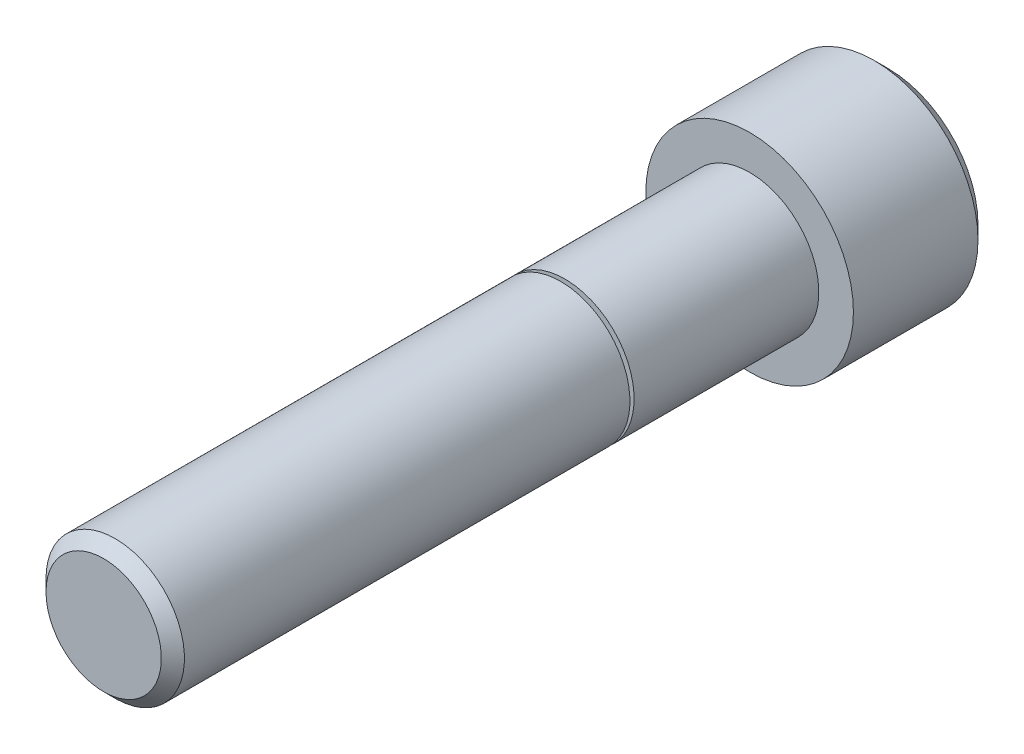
from build123d import *

# Parameters (mm, degrees)
CUT_EXTRUDE1_DEPTH = 4.7625


with BuildPart() as part:
    # Logo3_bib1 → Revolve1 (revolve)
    with BuildSketch(Plane(origin=(0, 0, 0), x_dir=(-1, 0, 0), z_dir=(0, -1, 0))):
        with BuildLine():
            Line((0, -44.45), (0, 9.525))
            Line((0, 9.525), (6.19125, 9.525))
            Line((6.19125, 9.525), (7.14375, 8.5725))
            Line((7.14375, 8.5725), (7.14375, 0))
            Line((7.14375, 0), (4.7625, 0))
            Line((4.7625, 0), (4.7625, -12.71))
            Line((4.7625, -12.71), (4.082175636, -12.71))
            ThreePointArc((4.082175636, -12.71), (4.062479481, -12.726527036), (4.075335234, -12.748793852))
            Line((4.075335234, -12.748793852), (4.7625, -12.998901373))
            Line((4.7625, -12.998901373), (4.7625, -43.65625))
            Line((4.7625, -43.65625), (3.96875, -44.45))
            Line((3.96875, -44.45), (0, -44.45))
        make_face()
    revolve(axis=Axis((0, 0, -10.585154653), (0, 0, 1)))

    # Logo3_bib2 → Cut-Extrude1 (cut)
    with BuildSketch(Plane(origin=(0, 0, -9.525), x_dir=(1, 0, 0), z_dir=(0, 0, -1))):
        Polygon((4.575385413, 0), (2.287692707, 3.9624), (-2.287692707, 3.9624), (-4.575385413, 0), (-2.287692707, -3.9624), (2.287692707, -3.9624), align=None)
    extrude(amount=-CUT_EXTRUDE1_DEPTH, mode=Mode.SUBTRACT)


solid = part.part
